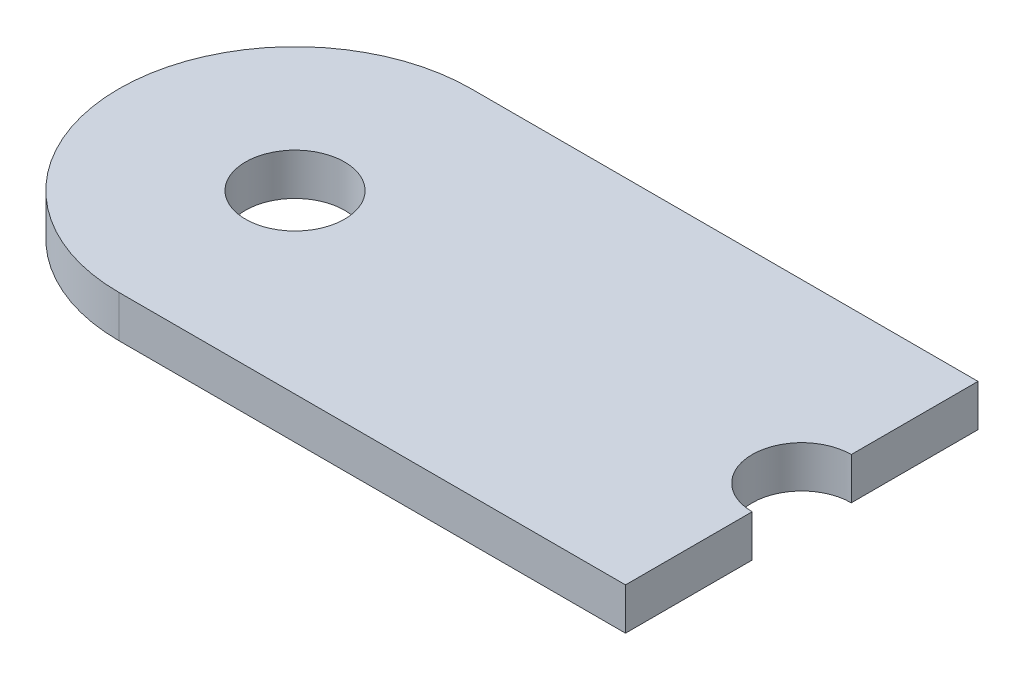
ISO-10303-21;
HEADER;
FILE_DESCRIPTION(('STEP AP214'),'2;1');
FILE_NAME('part.step','',(''),(''),'','','');
FILE_SCHEMA(('AUTOMOTIVE_DESIGN { 1 0 10303 214 1 1 1 1 }'));
ENDSEC;
DATA;
#1=APPLICATION_CONTEXT('core data for automotive mechanical design processes');
#2=APPLICATION_PROTOCOL_DEFINITION('international standard','automotive_design',2000,#1);
#3=PRODUCT_CONTEXT('',#1,'mechanical');
#4=PRODUCT('Part','Part','',(#3));
#5=PRODUCT_RELATED_PRODUCT_CATEGORY('part','',(#4));
#6=PRODUCT_DEFINITION_FORMATION('','',#4);
#7=PRODUCT_DEFINITION_CONTEXT('part definition',#1,'design');
#8=PRODUCT_DEFINITION('design','',#6,#7);
#9=PRODUCT_DEFINITION_SHAPE('','',#8);
#10=(LENGTH_UNIT() NAMED_UNIT(*) SI_UNIT(.MILLI.,.METRE.));
#11=(NAMED_UNIT(*) PLANE_ANGLE_UNIT() SI_UNIT($,.RADIAN.));
#12=(NAMED_UNIT(*) SI_UNIT($,.STERADIAN.) SOLID_ANGLE_UNIT());
#13=UNCERTAINTY_MEASURE_WITH_UNIT(LENGTH_MEASURE(1.E-05),#10,'distance_accuracy_value','');
#14=(GEOMETRIC_REPRESENTATION_CONTEXT(3) GLOBAL_UNCERTAINTY_ASSIGNED_CONTEXT((#13)) GLOBAL_UNIT_ASSIGNED_CONTEXT((#10,
#11,#12)) REPRESENTATION_CONTEXT('',''));
#15=CARTESIAN_POINT('',(0.,0.,0.));
#16=DIRECTION('',(0.,0.,1.));
#17=DIRECTION('',(1.,0.,0.));
#18=AXIS2_PLACEMENT_3D('',#15,#16,#17);
#19=CARTESIAN_POINT('',(11.5,0.95,0.));
#20=DIRECTION('',(0.,-1.,0.));
#21=DIRECTION('',(0.,0.,-1.));
#22=AXIS2_PLACEMENT_3D('',#19,#20,#21);
#23=CYLINDRICAL_SURFACE('',#22,2.25);
#24=CARTESIAN_POINT('',(11.5,-0.95,0.));
#25=DIRECTION('',(0.,1.,0.));
#26=DIRECTION('',(0.,0.,1.));
#27=AXIS2_PLACEMENT_3D('',#24,#25,#26);
#28=CIRCLE('',#27,2.25);
#29=CARTESIAN_POINT('',(11.5,-0.95,-2.25));
#30=VERTEX_POINT('',#29);
#31=CARTESIAN_POINT('',(11.5,-0.95,2.25));
#32=VERTEX_POINT('',#31);
#33=EDGE_CURVE('E131',#30,#32,#28,.T.);
#34=ORIENTED_EDGE('',*,*,#33,.F.);
#35=DIRECTION('',(0.,-1.,0.));
#36=VECTOR('',#35,1.);
#37=CARTESIAN_POINT('',(11.5,0.95,-2.25));
#38=LINE('',#37,#36);
#39=CARTESIAN_POINT('',(11.5,0.95,-2.25));
#40=VERTEX_POINT('',#39);
#41=EDGE_CURVE('E11',#40,#30,#38,.T.);
#42=ORIENTED_EDGE('',*,*,#41,.F.);
#43=CARTESIAN_POINT('',(11.5,0.95,0.));
#44=DIRECTION('',(0.,1.,0.));
#45=DIRECTION('',(0.,0.,1.));
#46=AXIS2_PLACEMENT_3D('',#43,#44,#45);
#47=CIRCLE('',#46,2.25);
#48=CARTESIAN_POINT('',(11.5,0.95,2.25));
#49=VERTEX_POINT('',#48);
#50=EDGE_CURVE('E152',#40,#49,#47,.T.);
#51=ORIENTED_EDGE('',*,*,#50,.T.);
#52=DIRECTION('',(0.,-1.,0.));
#53=VECTOR('',#52,1.);
#54=CARTESIAN_POINT('',(11.5,0.95,2.25));
#55=LINE('',#54,#53);
#56=EDGE_CURVE('E56',#49,#32,#55,.T.);
#57=ORIENTED_EDGE('',*,*,#56,.T.);
#58=EDGE_LOOP('',(#34,#42,#51,#57));
#59=FACE_BOUND('',#58,.T.);
#60=ADVANCED_FACE('F39',(#59),#23,.F.);
#61=CARTESIAN_POINT('',(11.5,0.95,0.));
#62=DIRECTION('',(1.,0.,0.));
#63=DIRECTION('',(0.,0.,-1.));
#64=AXIS2_PLACEMENT_3D('',#61,#62,#63);
#65=PLANE('',#64);
#66=DIRECTION('',(0.,0.,1.));
#67=VECTOR('',#66,1.);
#68=CARTESIAN_POINT('',(11.5,-0.95,0.));
#69=LINE('',#68,#67);
#70=CARTESIAN_POINT('',(11.5,-0.95,-8.));
#71=VERTEX_POINT('',#70);
#72=EDGE_CURVE('E134',#71,#30,#69,.T.);
#73=ORIENTED_EDGE('',*,*,#72,.F.);
#74=DIRECTION('',(0.,-1.,0.));
#75=VECTOR('',#74,1.);
#76=CARTESIAN_POINT('',(11.5,0.95,-8.));
#77=LINE('',#76,#75);
#78=CARTESIAN_POINT('',(11.5,0.95,-8.));
#79=VERTEX_POINT('',#78);
#80=EDGE_CURVE('E48',#79,#71,#77,.T.);
#81=ORIENTED_EDGE('',*,*,#80,.F.);
#82=DIRECTION('',(0.,0.,1.));
#83=VECTOR('',#82,1.);
#84=CARTESIAN_POINT('',(11.5,0.95,0.));
#85=LINE('',#84,#83);
#86=EDGE_CURVE('E125',#79,#40,#85,.T.);
#87=ORIENTED_EDGE('',*,*,#86,.T.);
#88=ORIENTED_EDGE('',*,*,#41,.T.);
#89=EDGE_LOOP('',(#73,#81,#87,#88));
#90=FACE_BOUND('',#89,.T.);
#91=ADVANCED_FACE('F165',(#90),#65,.T.);
#92=CARTESIAN_POINT('',(0.,0.95,-8.));
#93=DIRECTION('',(0.,0.,-1.));
#94=DIRECTION('',(-1.,0.,0.));
#95=AXIS2_PLACEMENT_3D('',#92,#93,#94);
#96=PLANE('',#95);
#97=DIRECTION('',(1.,0.,0.));
#98=VECTOR('',#97,1.);
#99=CARTESIAN_POINT('',(0.,-0.95,-8.));
#100=LINE('',#99,#98);
#101=CARTESIAN_POINT('',(-11.5,-0.95,-8.));
#102=VERTEX_POINT('',#101);
#103=EDGE_CURVE('E138',#102,#71,#100,.T.);
#104=ORIENTED_EDGE('',*,*,#103,.F.);
#105=DIRECTION('',(0.,-1.,0.));
#106=VECTOR('',#105,1.);
#107=CARTESIAN_POINT('',(-11.5,0.95,-8.));
#108=LINE('',#107,#106);
#109=CARTESIAN_POINT('',(-11.5,0.95,-8.));
#110=VERTEX_POINT('',#109);
#111=EDGE_CURVE('E116',#110,#102,#108,.T.);
#112=ORIENTED_EDGE('',*,*,#111,.F.);
#113=DIRECTION('',(1.,0.,0.));
#114=VECTOR('',#113,1.);
#115=CARTESIAN_POINT('',(0.,0.95,-8.));
#116=LINE('',#115,#114);
#117=EDGE_CURVE('E104',#110,#79,#116,.T.);
#118=ORIENTED_EDGE('',*,*,#117,.T.);
#119=ORIENTED_EDGE('',*,*,#80,.T.);
#120=EDGE_LOOP('',(#104,#112,#118,#119));
#121=FACE_BOUND('',#120,.T.);
#122=ADVANCED_FACE('F162',(#121),#96,.T.);
#123=CARTESIAN_POINT('',(-11.5,0.95,0.));
#124=DIRECTION('',(0.,-1.,0.));
#125=DIRECTION('',(0.,0.,-1.));
#126=AXIS2_PLACEMENT_3D('',#123,#124,#125);
#127=CYLINDRICAL_SURFACE('',#126,8.);
#128=CARTESIAN_POINT('',(-11.5,-0.95,0.));
#129=DIRECTION('',(0.,1.,0.));
#130=DIRECTION('',(0.,0.,1.));
#131=AXIS2_PLACEMENT_3D('',#128,#129,#130);
#132=CIRCLE('',#131,8.);
#133=CARTESIAN_POINT('',(-11.5,-0.95,8.));
#134=VERTEX_POINT('',#133);
#135=EDGE_CURVE('E112',#102,#134,#132,.T.);
#136=ORIENTED_EDGE('',*,*,#135,.T.);
#137=DIRECTION('',(0.,-1.,0.));
#138=VECTOR('',#137,1.);
#139=CARTESIAN_POINT('',(-11.5,0.95,8.));
#140=LINE('',#139,#138);
#141=CARTESIAN_POINT('',(-11.5,0.95,8.));
#142=VERTEX_POINT('',#141);
#143=EDGE_CURVE('E109',#142,#134,#140,.T.);
#144=ORIENTED_EDGE('',*,*,#143,.F.);
#145=CARTESIAN_POINT('',(-11.5,0.95,0.));
#146=DIRECTION('',(0.,1.,0.));
#147=DIRECTION('',(0.,0.,1.));
#148=AXIS2_PLACEMENT_3D('',#145,#146,#147);
#149=CIRCLE('',#148,8.);
#150=EDGE_CURVE('E95',#110,#142,#149,.T.);
#151=ORIENTED_EDGE('',*,*,#150,.F.);
#152=ORIENTED_EDGE('',*,*,#111,.T.);
#153=EDGE_LOOP('',(#136,#144,#151,#152));
#154=FACE_BOUND('',#153,.T.);
#155=ADVANCED_FACE('F110',(#154),#127,.T.);
#156=CARTESIAN_POINT('',(0.,0.95,8.));
#157=DIRECTION('',(0.,0.,-1.));
#158=DIRECTION('',(-1.,0.,0.));
#159=AXIS2_PLACEMENT_3D('',#156,#157,#158);
#160=PLANE('',#159);
#161=DIRECTION('',(1.,0.,0.));
#162=VECTOR('',#161,1.);
#163=CARTESIAN_POINT('',(0.,-0.95,8.));
#164=LINE('',#163,#162);
#165=CARTESIAN_POINT('',(11.5,-0.95,8.));
#166=VERTEX_POINT('',#165);
#167=EDGE_CURVE('E145',#134,#166,#164,.T.);
#168=ORIENTED_EDGE('',*,*,#167,.T.);
#169=DIRECTION('',(0.,-1.,0.));
#170=VECTOR('',#169,1.);
#171=CARTESIAN_POINT('',(11.5,0.95,8.));
#172=LINE('',#171,#170);
#173=CARTESIAN_POINT('',(11.5,0.95,8.));
#174=VERTEX_POINT('',#173);
#175=EDGE_CURVE('E76',#174,#166,#172,.T.);
#176=ORIENTED_EDGE('',*,*,#175,.F.);
#177=DIRECTION('',(1.,0.,0.));
#178=VECTOR('',#177,1.);
#179=CARTESIAN_POINT('',(0.,0.95,8.));
#180=LINE('',#179,#178);
#181=EDGE_CURVE('E101',#142,#174,#180,.T.);
#182=ORIENTED_EDGE('',*,*,#181,.F.);
#183=ORIENTED_EDGE('',*,*,#143,.T.);
#184=EDGE_LOOP('',(#168,#176,#182,#183));
#185=FACE_BOUND('',#184,.T.);
#186=ADVANCED_FACE('F118',(#185),#160,.F.);
#187=EDGE_CURVE('E139',#32,#166,#69,.T.);
#188=ORIENTED_EDGE('',*,*,#187,.F.);
#189=ORIENTED_EDGE('',*,*,#56,.F.);
#190=EDGE_CURVE('E120',#49,#174,#85,.T.);
#191=ORIENTED_EDGE('',*,*,#190,.T.);
#192=ORIENTED_EDGE('',*,*,#175,.T.);
#193=EDGE_LOOP('',(#188,#189,#191,#192));
#194=FACE_BOUND('',#193,.T.);
#195=ADVANCED_FACE('F180',(#194),#65,.T.);
#196=CARTESIAN_POINT('',(-11.5,0.95,0.));
#197=DIRECTION('',(0.,-1.,0.));
#198=DIRECTION('',(0.,0.,-1.));
#199=AXIS2_PLACEMENT_3D('',#196,#197,#198);
#200=CYLINDRICAL_SURFACE('',#199,2.25);
#201=CARTESIAN_POINT('',(-11.5,0.95,0.));
#202=DIRECTION('',(0.,1.,0.));
#203=DIRECTION('',(0.,0.,1.));
#204=AXIS2_PLACEMENT_3D('',#201,#202,#203);
#205=CIRCLE('',#204,2.25);
#206=CARTESIAN_POINT('',(-11.5,0.95,-2.25));
#207=VERTEX_POINT('',#206);
#208=EDGE_CURVE('E123',#207,#207,#205,.T.);
#209=CARTESIAN_POINT('',(-11.5,-0.95,0.));
#210=DIRECTION('',(0.,1.,0.));
#211=DIRECTION('',(0.,0.,1.));
#212=AXIS2_PLACEMENT_3D('',#209,#210,#211);
#213=CIRCLE('',#212,2.25);
#214=CARTESIAN_POINT('',(-11.5,-0.95,-2.25));
#215=VERTEX_POINT('',#214);
#216=EDGE_CURVE('E148',#215,#215,#213,.T.);
#217=CARTESIAN_POINT('',(-11.5,0.95,-2.25));
#218=CARTESIAN_POINT('',(-11.5,0.930208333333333,-2.25));
#219=CARTESIAN_POINT('',(-11.5,0.910416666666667,-2.25));
#220=CARTESIAN_POINT('',(-11.5,0.870833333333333,-2.25));
#221=CARTESIAN_POINT('',(-11.5,0.851041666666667,-2.25));
#222=CARTESIAN_POINT('',(-11.5,0.811458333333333,-2.25));
#223=CARTESIAN_POINT('',(-11.5,0.791666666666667,-2.25));
#224=CARTESIAN_POINT('',(-11.5,0.752083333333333,-2.25));
#225=CARTESIAN_POINT('',(-11.5,0.732291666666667,-2.25));
#226=CARTESIAN_POINT('',(-11.5,0.692708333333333,-2.25));
#227=CARTESIAN_POINT('',(-11.5,0.672916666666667,-2.25));
#228=CARTESIAN_POINT('',(-11.5,0.633333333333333,-2.25));
#229=CARTESIAN_POINT('',(-11.5,0.613541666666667,-2.25));
#230=CARTESIAN_POINT('',(-11.5,0.573958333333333,-2.25));
#231=CARTESIAN_POINT('',(-11.5,0.554166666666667,-2.25));
#232=CARTESIAN_POINT('',(-11.5,0.514583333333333,-2.25));
#233=CARTESIAN_POINT('',(-11.5,0.494791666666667,-2.25));
#234=CARTESIAN_POINT('',(-11.5,0.455208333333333,-2.25));
#235=CARTESIAN_POINT('',(-11.5,0.435416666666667,-2.25));
#236=CARTESIAN_POINT('',(-11.5,0.395833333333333,-2.25));
#237=CARTESIAN_POINT('',(-11.5,0.376041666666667,-2.25));
#238=CARTESIAN_POINT('',(-11.5,0.336458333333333,-2.25));
#239=CARTESIAN_POINT('',(-11.5,0.316666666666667,-2.25));
#240=CARTESIAN_POINT('',(-11.5,0.277083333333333,-2.25));
#241=CARTESIAN_POINT('',(-11.5,0.257291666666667,-2.25));
#242=CARTESIAN_POINT('',(-11.5,0.217708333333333,-2.25));
#243=CARTESIAN_POINT('',(-11.5,0.197916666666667,-2.25));
#244=CARTESIAN_POINT('',(-11.5,0.158333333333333,-2.25));
#245=CARTESIAN_POINT('',(-11.5,0.138541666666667,-2.25));
#246=CARTESIAN_POINT('',(-11.5,0.0989583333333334,-2.25));
#247=CARTESIAN_POINT('',(-11.5,0.0791666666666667,-2.25));
#248=CARTESIAN_POINT('',(-11.5,0.0395833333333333,-2.25));
#249=CARTESIAN_POINT('',(-11.5,0.0197916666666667,-2.25));
#250=CARTESIAN_POINT('',(-11.5,-0.0197916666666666,-2.25));
#251=CARTESIAN_POINT('',(-11.5,-0.0395833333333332,-2.25));
#252=CARTESIAN_POINT('',(-11.5,-0.0791666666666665,-2.25));
#253=CARTESIAN_POINT('',(-11.5,-0.0989583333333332,-2.25));
#254=CARTESIAN_POINT('',(-11.5,-0.138541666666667,-2.25));
#255=CARTESIAN_POINT('',(-11.5,-0.158333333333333,-2.25));
#256=CARTESIAN_POINT('',(-11.5,-0.197916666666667,-2.25));
#257=CARTESIAN_POINT('',(-11.5,-0.217708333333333,-2.25));
#258=CARTESIAN_POINT('',(-11.5,-0.257291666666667,-2.25));
#259=CARTESIAN_POINT('',(-11.5,-0.277083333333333,-2.25));
#260=CARTESIAN_POINT('',(-11.5,-0.316666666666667,-2.25));
#261=CARTESIAN_POINT('',(-11.5,-0.336458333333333,-2.25));
#262=CARTESIAN_POINT('',(-11.5,-0.376041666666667,-2.25));
#263=CARTESIAN_POINT('',(-11.5,-0.395833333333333,-2.25));
#264=CARTESIAN_POINT('',(-11.5,-0.435416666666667,-2.25));
#265=CARTESIAN_POINT('',(-11.5,-0.455208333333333,-2.25));
#266=CARTESIAN_POINT('',(-11.5,-0.494791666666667,-2.25));
#267=CARTESIAN_POINT('',(-11.5,-0.514583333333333,-2.25));
#268=CARTESIAN_POINT('',(-11.5,-0.554166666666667,-2.25));
#269=CARTESIAN_POINT('',(-11.5,-0.573958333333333,-2.25));
#270=CARTESIAN_POINT('',(-11.5,-0.613541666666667,-2.25));
#271=CARTESIAN_POINT('',(-11.5,-0.633333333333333,-2.25));
#272=CARTESIAN_POINT('',(-11.5,-0.672916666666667,-2.25));
#273=CARTESIAN_POINT('',(-11.5,-0.692708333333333,-2.25));
#274=CARTESIAN_POINT('',(-11.5,-0.732291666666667,-2.25));
#275=CARTESIAN_POINT('',(-11.5,-0.752083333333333,-2.25));
#276=CARTESIAN_POINT('',(-11.5,-0.791666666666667,-2.25));
#277=CARTESIAN_POINT('',(-11.5,-0.811458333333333,-2.25));
#278=CARTESIAN_POINT('',(-11.5,-0.851041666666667,-2.25));
#279=CARTESIAN_POINT('',(-11.5,-0.870833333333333,-2.25));
#280=CARTESIAN_POINT('',(-11.5,-0.910416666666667,-2.25));
#281=CARTESIAN_POINT('',(-11.5,-0.930208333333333,-2.25));
#282=CARTESIAN_POINT('',(-11.5,-0.95,-2.25));
#283=B_SPLINE_CURVE_WITH_KNOTS('',3,(#217,#218,#219,#220,#221,#222,#223,#224,#225,#226,#227,
#228,#229,#230,#231,#232,#233,#234,#235,#236,#237,#238,#239,#240,#241,#242,#243,#244,#245,#246,
#247,#248,#249,#250,#251,#252,#253,#254,#255,#256,#257,#258,#259,#260,#261,#262,#263,#264,#265,
#266,#267,#268,#269,#270,#271,#272,#273,#274,#275,#276,#277,#278,#279,#280,#281,#282),
.UNSPECIFIED.,.F.,.F.,(4,2,2,2,2,2,2,2,2,2,2,2,2,2,2,2,2,2,2,2,2,2,2,2,2,2,2,2,2,2,2,2,4),(0.,
0.0593750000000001,0.11875,0.178125,0.2375,0.296875,0.35625,0.415625,0.475,0.534375,0.59375,
0.653125,0.7125,0.771875,0.83125,0.890625,0.95,1.009375,1.06875,1.128125,1.1875,1.246875,
1.30625,1.365625,1.425,1.484375,1.54375,1.603125,1.6625,1.721875,1.78125,1.840625,1.9),.UNSPECIFIED.);
#284=EDGE_CURVE('BSEAM187',#207,#215,#283,.T.);
#285=ORIENTED_EDGE('',*,*,#208,.T.);
#286=ORIENTED_EDGE('',*,*,#216,.F.);
#287=ORIENTED_EDGE('',*,*,#284,.T.);
#288=ORIENTED_EDGE('',*,*,#284,.F.);
#289=EDGE_LOOP('',(#285,#287,#286,#288));
#290=FACE_BOUND('',#289,.T.);
#291=ADVANCED_FACE('F187',(#290),#200,.F.);
#292=CARTESIAN_POINT('',(0.,0.95,0.));
#293=DIRECTION('',(0.,1.,0.));
#294=DIRECTION('',(0.,0.,1.));
#295=AXIS2_PLACEMENT_3D('',#292,#293,#294);
#296=PLANE('',#295);
#297=ORIENTED_EDGE('',*,*,#50,.F.);
#298=ORIENTED_EDGE('',*,*,#86,.F.);
#299=ORIENTED_EDGE('',*,*,#117,.F.);
#300=ORIENTED_EDGE('',*,*,#150,.T.);
#301=ORIENTED_EDGE('',*,*,#181,.T.);
#302=ORIENTED_EDGE('',*,*,#190,.F.);
#303=EDGE_LOOP('',(#297,#298,#299,#300,#301,#302));
#304=FACE_BOUND('',#303,.T.);
#305=ORIENTED_EDGE('',*,*,#208,.F.);
#306=EDGE_LOOP('',(#305));
#307=FACE_BOUND('',#306,.T.);
#308=ADVANCED_FACE('F97',(#304,#307),#296,.T.);
#309=CARTESIAN_POINT('',(0.,-0.95,0.));
#310=DIRECTION('',(0.,1.,0.));
#311=DIRECTION('',(0.,0.,1.));
#312=AXIS2_PLACEMENT_3D('',#309,#310,#311);
#313=PLANE('',#312);
#314=ORIENTED_EDGE('',*,*,#33,.T.);
#315=ORIENTED_EDGE('',*,*,#187,.T.);
#316=ORIENTED_EDGE('',*,*,#167,.F.);
#317=ORIENTED_EDGE('',*,*,#135,.F.);
#318=ORIENTED_EDGE('',*,*,#103,.T.);
#319=ORIENTED_EDGE('',*,*,#72,.T.);
#320=EDGE_LOOP('',(#314,#315,#316,#317,#318,#319));
#321=FACE_BOUND('',#320,.T.);
#322=ORIENTED_EDGE('',*,*,#216,.T.);
#323=EDGE_LOOP('',(#322));
#324=FACE_BOUND('',#323,.T.);
#325=ADVANCED_FACE('F167',(#321,#324),#313,.F.);
#326=CLOSED_SHELL('',(#60,#91,#122,#155,#186,#195,#291,#308,#325));
#327=MANIFOLD_SOLID_BREP('B2',#326);
#328=ADVANCED_BREP_SHAPE_REPRESENTATION('',(#18,#327),#14);
#329=SHAPE_DEFINITION_REPRESENTATION(#9,#328);
ENDSEC;
END-ISO-10303-21;
